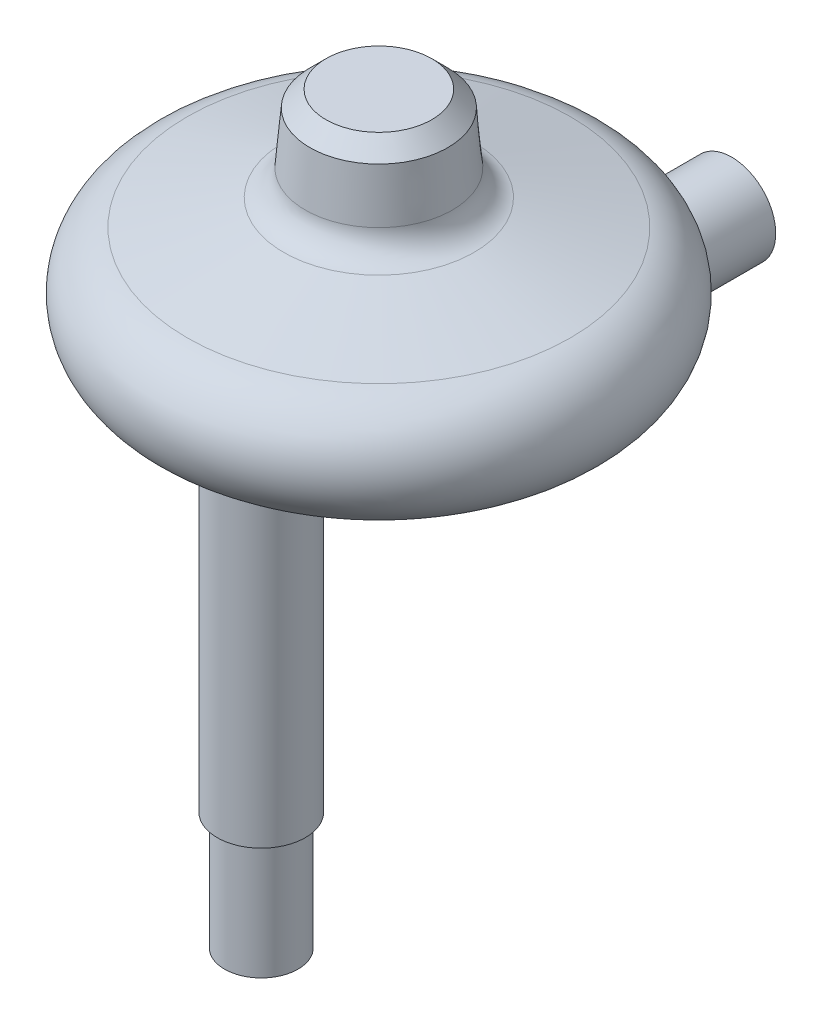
from build123d import *

# Parameters (mm, degrees)
SKETCH2_R           = 9.525
BOSS_EXTRUDE1_DEPTH = 25.4
BOSS_EXTRUDE1_DRAFT = -5
FILLET1_R           = 3.175
SKETCH3_R           = 4.7625
BOSS_EXTRUDE2_DEPTH = 35.875
FILLET2_R           = 3.175
BOSS_EXTRUDE3_DEPTH = 19.05
FILLET4_R           = 1.5875
FILLET8_R           = 1.5875
CHAMFER1_SIZE       = 1.5875
CHAMFER1_SIZE2      = 1.746349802
SKETCH5_R           = 4.7625
BOSS_EXTRUDE4_DEPTH = 12.7
SKETCH6_R           = 3.96875
BOSS_EXTRUDE5_DEPTH = 12.7


with BuildPart() as part:
    # Sketch1 → Base-Revolve (revolve)
    with BuildSketch(Plane.XY, mode=Mode.PRIVATE) as base_revolve_sk:
        with BuildLine():
            Line((0, 0), (19.05, 0))
            ThreePointArc((19.05, 0), (25.34567487, 5.521158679), (20.693500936, 12.483628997))
            Line((20.693500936, 12.483628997), (0, 18.028435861))
            Line((0, 18.028435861), (0, 0))
        make_face()
    revolve(base_revolve_sk.sketch.rotate(Axis((0, 0, 0), (0, 1, 0)), 90), axis=Axis((0, 0, 0), (0, 1, 0)))


with BuildPart() as boss_extrude1_tool:
    # Sketch2 → Boss-Extrude1 (with draft: the straight prism first)
    with BuildSketch(Plane.XZ):
        Circle(SKETCH2_R)
    extrude(amount=-BOSS_EXTRUDE1_DEPTH)
    # Boss-Extrude1: the draft: its side faces are tilted about the plane it starts from
    boss_extrude1_sides = [boss_extrude1_tool.faces().sort_by_distance(p)[0] for p in [
        (-9.525, 12.7, 0),
    ]]
    draft(boss_extrude1_sides, Plane.XZ, BOSS_EXTRUDE1_DRAFT)


with BuildPart() as part_1:
    add(part.part)

    # Boss-Extrude1: add boss_extrude1_tool
    add(boss_extrude1_tool.part)

    # Fillet1
    fillet1_edges = [part_1.edges().sort_by_distance(p)[0] for p in [
        (-5.754790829, 15.847730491, 5.754790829),
    ]]
    fillet(fillet1_edges, radius=FILLET1_R)

    # Sketch3 → Boss-Extrude2 (add)
    with BuildSketch(Plane.XZ):
        with Locations(Location((0, 12.7, 0), (0, 0, 270))):
            Circle(SKETCH3_R)
    extrude(amount=BOSS_EXTRUDE2_DEPTH)

    # Fillet2
    fillet2_edges = [part_1.edges().sort_by_distance(p)[0] for p in [
        (0, 0, 17.4625),
    ]]
    fillet(fillet2_edges, radius=FILLET2_R)

    # Sketch4 → Boss-Extrude3 (add)
    with BuildSketch(Plane.XY.offset(-6.35)):
        with BuildLine():
            Line((-4.7625, 1.5875), (4.7625, 1.5875))
            Line((4.7625, 1.5875), (4.7625, -4.7625))
            ThreePointArc((4.7625, -4.7625), (0, -9.525), (-4.7625, -4.7625))
            Line((-4.7625, -4.7625), (-4.7625, 1.5875))
        make_face()
    extrude(amount=-BOSS_EXTRUDE3_DEPTH)

    # Fillet4
    fillet4_edges = [part_1.edges().sort_by_distance(p)[0] for p in [
        (4.7625, -2.38125, -6.35),
        (-4.7625, -2.38125, -6.35),
        (0, -9.525, -6.35),
    ]]
    fillet(fillet4_edges, radius=FILLET4_R)

    # Fillet8
    fillet8_edges = [part_1.edges().sort_by_distance(p)[0] for p in [
        (0, 12.483628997, 20.693500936),
        (0, 12.483628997, 20.693500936),
        (4.7625, 0, -13.191291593),
        (0, 0, -6.35),
        (-4.7625, 0, -13.191291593),
        (4.297532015, 0, -6.814967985),
        (-4.297532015, 0, -6.814967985),
    ]]
    fillet(fillet8_edges, radius=FILLET8_R)

    # Chamfer1
    chamfer1_edges = [part_1.edges().sort_by_distance(p)[0] for p in [
        (-7.302787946, 25.4, 0),
    ]]
    chamfer1_side = [part_1.faces().sort_by_distance(p)[0] for p in [
        (0, 25.4, 0),
    ]]
    chamfer(chamfer1_edges, length=CHAMFER1_SIZE, length2=CHAMFER1_SIZE2, reference=chamfer1_side[0])

    # Sketch5 → Boss-Extrude4 (add)
    with BuildSketch(Plane(origin=(0, 0, -25.4), x_dir=(-1, 0, 0), z_dir=(0, 0, -1))):
        with Locations((0, -4.7625)):
            Circle(SKETCH5_R)
    extrude(amount=BOSS_EXTRUDE4_DEPTH)

    # Sketch6 → Boss-Extrude5 (add)
    with BuildSketch(Plane.XZ.offset(35.875)):
        with Locations(Location((0, 12.7, 0), (0, 0, 270))):
            Circle(SKETCH6_R)
    extrude(amount=BOSS_EXTRUDE5_DEPTH)


solid = part_1.part
